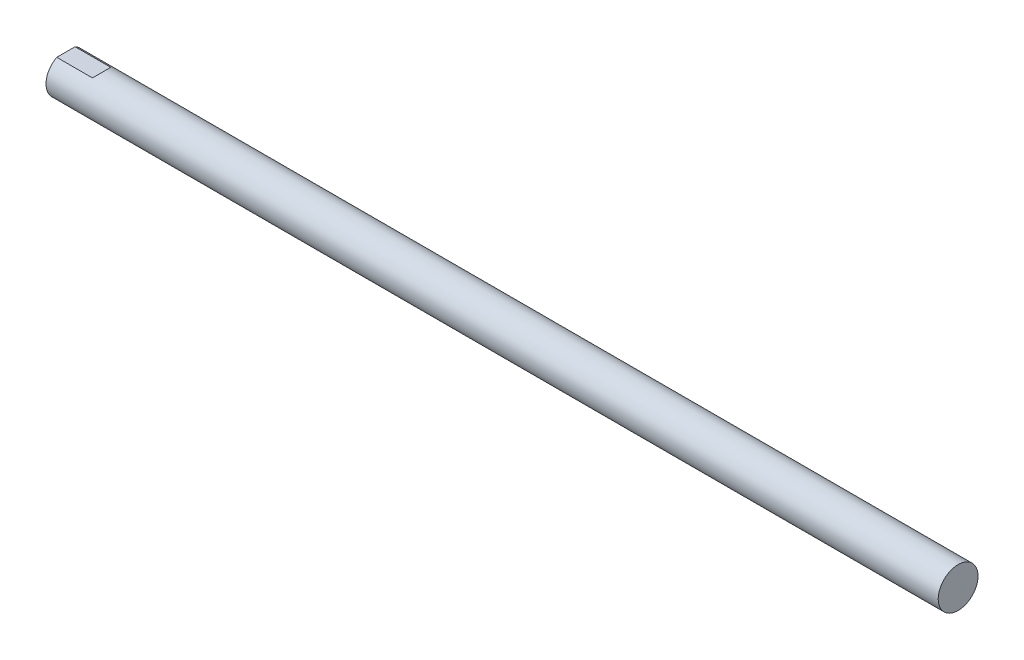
ISO-10303-21;
HEADER;
FILE_DESCRIPTION(('STEP AP214'),'2;1');
FILE_NAME('part.step','',(''),(''),'','','');
FILE_SCHEMA(('AUTOMOTIVE_DESIGN { 1 0 10303 214 1 1 1 1 }'));
ENDSEC;
DATA;
#1=APPLICATION_CONTEXT('core data for automotive mechanical design processes');
#2=APPLICATION_PROTOCOL_DEFINITION('international standard','automotive_design',2000,#1);
#3=PRODUCT_CONTEXT('',#1,'mechanical');
#4=PRODUCT('Part','Part','',(#3));
#5=PRODUCT_RELATED_PRODUCT_CATEGORY('part','',(#4));
#6=PRODUCT_DEFINITION_FORMATION('','',#4);
#7=PRODUCT_DEFINITION_CONTEXT('part definition',#1,'design');
#8=PRODUCT_DEFINITION('design','',#6,#7);
#9=PRODUCT_DEFINITION_SHAPE('','',#8);
#10=(LENGTH_UNIT() NAMED_UNIT(*) SI_UNIT(.MILLI.,.METRE.));
#11=(NAMED_UNIT(*) PLANE_ANGLE_UNIT() SI_UNIT($,.RADIAN.));
#12=(NAMED_UNIT(*) SI_UNIT($,.STERADIAN.) SOLID_ANGLE_UNIT());
#13=UNCERTAINTY_MEASURE_WITH_UNIT(LENGTH_MEASURE(1.E-05),#10,'distance_accuracy_value','');
#14=(GEOMETRIC_REPRESENTATION_CONTEXT(3) GLOBAL_UNCERTAINTY_ASSIGNED_CONTEXT((#13)) GLOBAL_UNIT_ASSIGNED_CONTEXT((#10,
#11,#12)) REPRESENTATION_CONTEXT('',''));
#15=CARTESIAN_POINT('',(0.,0.,0.));
#16=DIRECTION('',(0.,0.,1.));
#17=DIRECTION('',(1.,0.,0.));
#18=AXIS2_PLACEMENT_3D('',#15,#16,#17);
#19=CARTESIAN_POINT('',(0.,0.,0.));
#20=DIRECTION('',(1.,0.,0.));
#21=DIRECTION('',(0.,0.,-1.));
#22=AXIS2_PLACEMENT_3D('',#19,#20,#21);
#23=PLANE('',#22);
#24=CARTESIAN_POINT('',(0.,0.,0.));
#25=DIRECTION('',(-1.,0.,0.));
#26=DIRECTION('',(0.,0.,1.));
#27=AXIS2_PLACEMENT_3D('',#24,#25,#26);
#28=CIRCLE('',#27,3.2639);
#29=CARTESIAN_POINT('',(0.,0.,3.2639));
#30=VERTEX_POINT('',#29);
#31=EDGE_CURVE('E74',#30,#30,#28,.T.);
#32=ORIENTED_EDGE('',*,*,#31,.F.);
#33=EDGE_LOOP('',(#32));
#34=FACE_BOUND('',#33,.T.);
#35=CARTESIAN_POINT('',(0.,0.,0.));
#36=DIRECTION('',(-1.,0.,0.));
#37=DIRECTION('',(0.,0.,1.));
#38=AXIS2_PLACEMENT_3D('',#35,#36,#37);
#39=CIRCLE('',#38,7.9375);
#40=CARTESIAN_POINT('',(0.,7.0485,-3.65000739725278));
#41=VERTEX_POINT('',#40);
#42=CARTESIAN_POINT('',(0.,7.0485,3.65000739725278));
#43=VERTEX_POINT('',#42);
#44=EDGE_CURVE('E86',#41,#43,#39,.T.);
#45=ORIENTED_EDGE('',*,*,#44,.T.);
#46=DIRECTION('',(0.,0.,1.));
#47=VECTOR('',#46,1.);
#48=CARTESIAN_POINT('',(0.,7.0485,-7.9375));
#49=LINE('',#48,#47);
#50=EDGE_CURVE('E72',#41,#43,#49,.T.);
#51=ORIENTED_EDGE('',*,*,#50,.F.);
#52=EDGE_LOOP('',(#45,#51));
#53=FACE_BOUND('',#52,.T.);
#54=ADVANCED_FACE('F36',(#34,#53),#23,.F.);
#55=CARTESIAN_POINT('',(-29.8621621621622,0.,0.));
#56=DIRECTION('',(-1.,0.,0.));
#57=DIRECTION('',(0.,0.,1.));
#58=AXIS2_PLACEMENT_3D('',#55,#56,#57);
#59=CYLINDRICAL_SURFACE('',#58,7.9375);
#60=CARTESIAN_POINT('',(7.17549999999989,0.,0.));
#61=DIRECTION('',(0.707106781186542,-0.707106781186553,0.));
#62=DIRECTION('',(-0.707106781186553,-0.707106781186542,0.));
#63=AXIS2_PLACEMENT_3D('',#60,#61,#62);
#64=ELLIPSE('',#63,11.2253201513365,7.9375);
#65=CARTESIAN_POINT('',(14.224,7.0485,-3.65000739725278));
#66=VERTEX_POINT('',#65);
#67=CARTESIAN_POINT('',(14.224,7.0485,3.65000739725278));
#68=VERTEX_POINT('',#67);
#69=EDGE_CURVE('E43',#66,#68,#64,.T.);
#70=ORIENTED_EDGE('',*,*,#69,.T.);
#71=DIRECTION('',(-1.,0.,0.));
#72=VECTOR('',#71,1.);
#73=CARTESIAN_POINT('',(-29.8621621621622,7.0485,3.65000739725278));
#74=LINE('',#73,#72);
#75=EDGE_CURVE('E11',#68,#43,#74,.T.);
#76=ORIENTED_EDGE('',*,*,#75,.T.);
#77=ORIENTED_EDGE('',*,*,#44,.F.);
#78=DIRECTION('',(-1.,0.,0.));
#79=VECTOR('',#78,1.);
#80=CARTESIAN_POINT('',(-29.8621621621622,7.0485,-3.65000739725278));
#81=LINE('',#80,#79);
#82=EDGE_CURVE('E68',#41,#66,#81,.F.);
#83=ORIENTED_EDGE('',*,*,#82,.T.);
#84=EDGE_LOOP('',(#70,#76,#77,#83));
#85=FACE_BOUND('',#84,.T.);
#86=CARTESIAN_POINT('',(355.6,0.,0.));
#87=DIRECTION('',(-1.,0.,0.));
#88=DIRECTION('',(0.,0.,1.));
#89=AXIS2_PLACEMENT_3D('',#86,#87,#88);
#90=CIRCLE('',#89,7.9375);
#91=CARTESIAN_POINT('',(355.6,0.,7.9375));
#92=VERTEX_POINT('',#91);
#93=EDGE_CURVE('E83',#92,#92,#90,.T.);
#94=ORIENTED_EDGE('',*,*,#93,.T.);
#95=EDGE_LOOP('',(#94));
#96=FACE_BOUND('',#95,.T.);
#97=ADVANCED_FACE('F64',(#85,#96),#59,.T.);
#98=CARTESIAN_POINT('',(355.6,7.9375,0.));
#99=DIRECTION('',(-1.,0.,0.));
#100=DIRECTION('',(0.,0.,1.));
#101=AXIS2_PLACEMENT_3D('',#98,#99,#100);
#102=PLANE('',#101);
#103=ORIENTED_EDGE('',*,*,#93,.F.);
#104=EDGE_LOOP('',(#103));
#105=FACE_BOUND('',#104,.T.);
#106=ADVANCED_FACE('F94',(#105),#102,.F.);
#107=CARTESIAN_POINT('',(22.9362,0.,0.));
#108=DIRECTION('',(-1.,0.,0.));
#109=DIRECTION('',(0.,0.,1.));
#110=AXIS2_PLACEMENT_3D('',#107,#108,#109);
#111=CONICAL_SURFACE('',#110,3.2639,1.02974425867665);
#112=CARTESIAN_POINT('',(24.8973489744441,0.,0.));
#113=VERTEX_POINT('',#112);
#114=VERTEX_LOOP('',#113);
#115=FACE_BOUND('',#114,.T.);
#116=CARTESIAN_POINT('',(22.9362,0.,0.));
#117=DIRECTION('',(-1.,0.,0.));
#118=DIRECTION('',(0.,0.,1.));
#119=AXIS2_PLACEMENT_3D('',#116,#117,#118);
#120=CIRCLE('',#119,3.2639);
#121=CARTESIAN_POINT('',(22.9362,0.,3.2639));
#122=VERTEX_POINT('',#121);
#123=EDGE_CURVE('E77',#122,#122,#120,.T.);
#124=ORIENTED_EDGE('',*,*,#123,.T.);
#125=EDGE_LOOP('',(#124));
#126=FACE_BOUND('',#125,.T.);
#127=ADVANCED_FACE('F99',(#115,#126),#111,.F.);
#128=CARTESIAN_POINT('',(0.,0.,0.));
#129=DIRECTION('',(-1.,0.,0.));
#130=DIRECTION('',(0.,0.,1.));
#131=AXIS2_PLACEMENT_3D('',#128,#129,#130);
#132=CYLINDRICAL_SURFACE('',#131,3.2639);
#133=ORIENTED_EDGE('',*,*,#123,.F.);
#134=EDGE_LOOP('',(#133));
#135=FACE_BOUND('',#134,.T.);
#136=ORIENTED_EDGE('',*,*,#31,.T.);
#137=EDGE_LOOP('',(#136));
#138=FACE_BOUND('',#137,.T.);
#139=ADVANCED_FACE('F97',(#135,#138),#132,.F.);
#140=CARTESIAN_POINT('',(14.224,7.0485,-7.9375));
#141=DIRECTION('',(0.707106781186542,-0.707106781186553,0.));
#142=DIRECTION('',(0.707106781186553,0.707106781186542,0.));
#143=AXIS2_PLACEMENT_3D('',#140,#141,#142);
#144=PLANE('',#143);
#145=DIRECTION('',(0.,0.,1.));
#146=VECTOR('',#145,1.);
#147=CARTESIAN_POINT('',(14.224,7.0485,-7.9375));
#148=LINE('',#147,#146);
#149=EDGE_CURVE('E50',#66,#68,#148,.T.);
#150=ORIENTED_EDGE('',*,*,#149,.T.);
#151=ORIENTED_EDGE('',*,*,#69,.F.);
#152=EDGE_LOOP('',(#150,#151));
#153=FACE_BOUND('',#152,.T.);
#154=ADVANCED_FACE('F73',(#153),#144,.F.);
#155=CARTESIAN_POINT('',(0.,7.0485,-7.9375));
#156=DIRECTION('',(0.,-1.,0.));
#157=DIRECTION('',(0.,0.,-1.));
#158=AXIS2_PLACEMENT_3D('',#155,#156,#157);
#159=PLANE('',#158);
#160=ORIENTED_EDGE('',*,*,#149,.F.);
#161=ORIENTED_EDGE('',*,*,#82,.F.);
#162=ORIENTED_EDGE('',*,*,#50,.T.);
#163=ORIENTED_EDGE('',*,*,#75,.F.);
#164=EDGE_LOOP('',(#160,#161,#162,#163));
#165=FACE_BOUND('',#164,.T.);
#166=ADVANCED_FACE('F70',(#165),#159,.F.);
#167=CLOSED_SHELL('',(#54,#97,#106,#127,#139,#154,#166));
#168=MANIFOLD_SOLID_BREP('B2',#167);
#169=ADVANCED_BREP_SHAPE_REPRESENTATION('',(#18,#168),#14);
#170=SHAPE_DEFINITION_REPRESENTATION(#9,#169);
ENDSEC;
END-ISO-10303-21;
